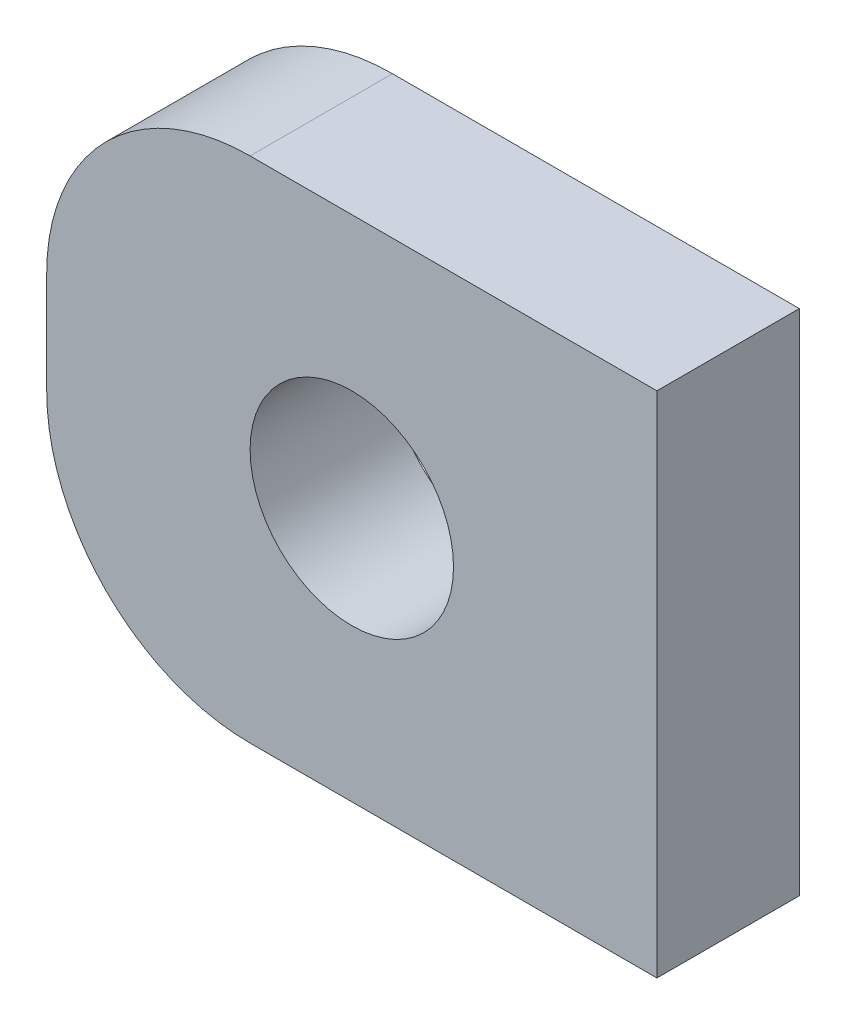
from build123d import *

# Parameters (mm, degrees)
SKETCH1_W           = 30
SKETCH1_H           = 25
BOSS_EXTRUDE1_DEPTH = 3.5
SKETCH2_R           = 5
CUT_EXTRUDE1_DEPTH  = 7
FILLET1_R           = 10


with BuildPart() as part:
    # Sketch1 → Boss-Extrude1 (new, symmetric)
    with BuildSketch(Plane.XY):
        with Locations((-20, -24.747448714)):
            Rectangle(SKETCH1_W, SKETCH1_H)
    extrude(amount=BOSS_EXTRUDE1_DEPTH, both=True)

    # Sketch2 → Cut-Extrude1 (cut)
    with BuildSketch(Plane(origin=(0, 0, -3.5), x_dir=(-1, 0, 0), z_dir=(0, 0, -1))):
        with Locations((20, -24.747448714)):
            Circle(SKETCH2_R)
    extrude(amount=-CUT_EXTRUDE1_DEPTH, mode=Mode.SUBTRACT)

    # Fillet1
    fillet1_edges = [part.edges().sort_by_distance(p)[0] for p in [
        (-35, -37.247448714, 0),
        (-35, -12.247448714, 0),
    ]]
    fillet(fillet1_edges, radius=FILLET1_R)


solid = part.part
